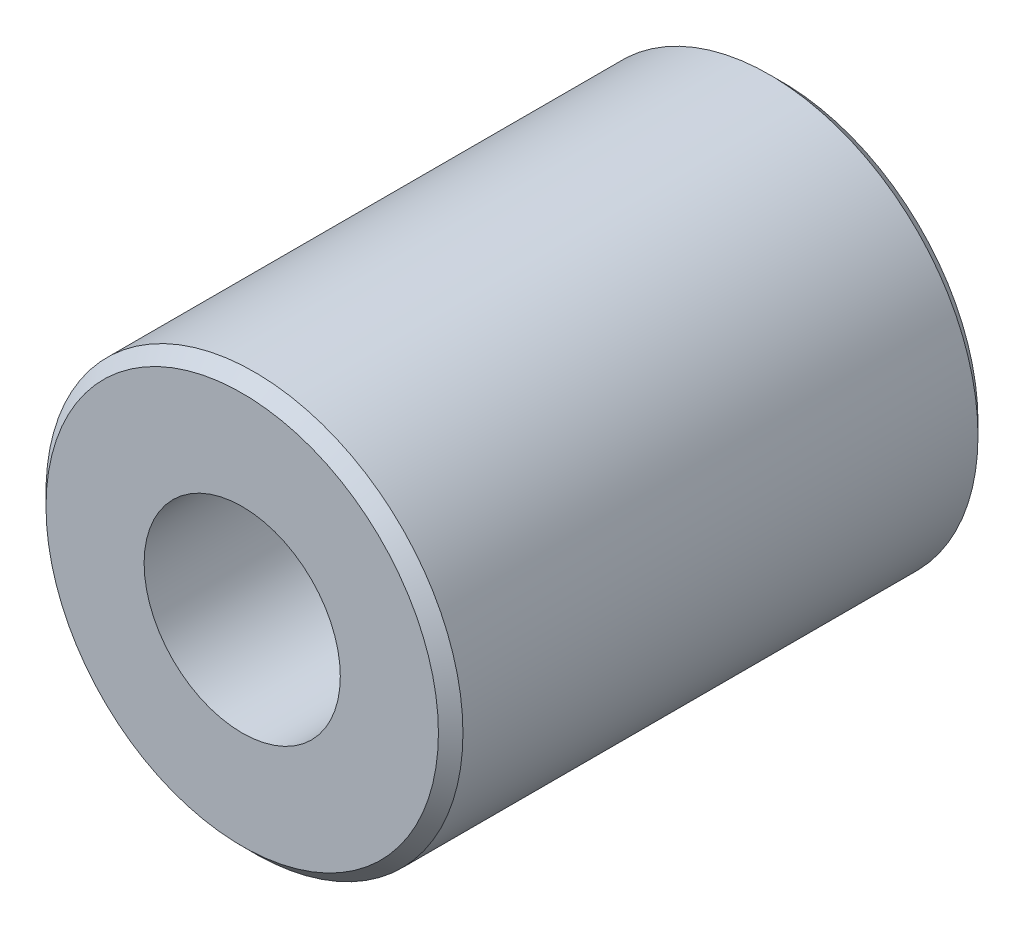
from build123d import *

# Parameters (mm, degrees)
ESQUISSE1_R      = 4.25
ESQUISSE1_R_2    = 2
EXTRUSION1_DEPTH = 11
CHANFREIN1_SIZE  = 0.25


with BuildPart() as part:
    # Esquisse1 → Extrusion1 (new body)
    with BuildSketch(Plane.XY):
        Circle(ESQUISSE1_R)
        Circle(ESQUISSE1_R_2, mode=Mode.SUBTRACT)
    extrude(amount=EXTRUSION1_DEPTH)

    # Chanfrein1
    chanfrein1_edges = [part.edges().sort_by_distance(p)[0] for p in [
        (-4.25, 0, 0),
        (-4.25, 0, 11),
    ]]
    chamfer(chanfrein1_edges, length=CHANFREIN1_SIZE)


solid = part.part
